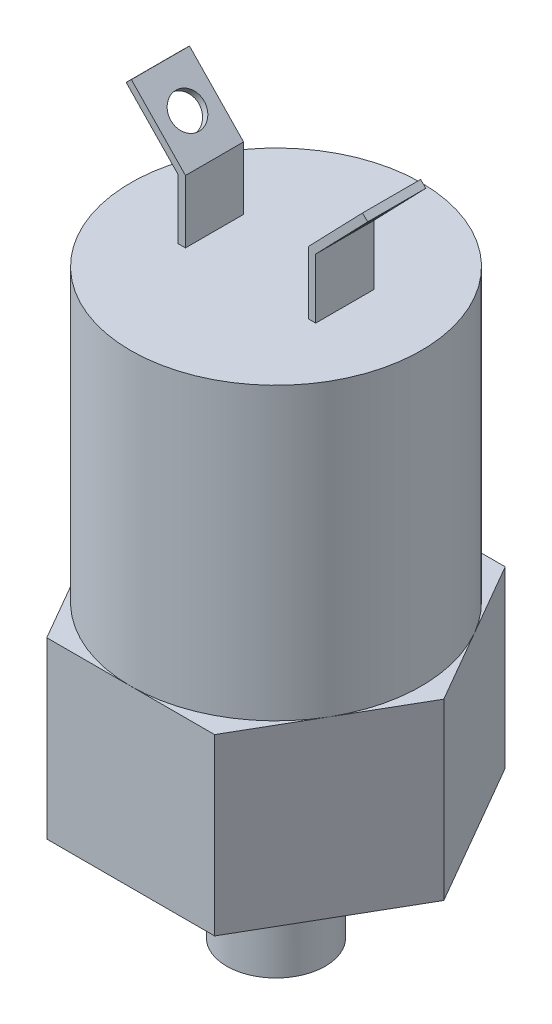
from build123d import *

# Parameters (mm, degrees)
BOSS_EXTRUDE1_DEPTH = 15.24
SKETCH3_R           = 12.7
BOSS_EXTRUDE2_DEPTH = 25.4
SKETCH4_R           = 4.3053
BOSS_EXTRUDE3_DEPTH = 10.16
EXTRUDE_THIN1_DEPTH = 2.54
CUT_EXTRUDE1_REACH  = 50.698
SKETCH6_R           = 1.4605


with BuildPart() as part:
    # Sketch2 → Boss-Extrude1 (new body)
    with BuildSketch(Plane(origin=(0, 0, 0), x_dir=(1, 0, 0), z_dir=(0, 1, 0))):
        Polygon((7.332348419, 12.7), (-7.332348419, 12.7), (-14.664696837, 0), (-7.332348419, -12.7), (7.332348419, -12.7), (14.664696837, 0), align=None)
    extrude(amount=BOSS_EXTRUDE1_DEPTH)

    # Sketch3 → Boss-Extrude2 (add)
    with BuildSketch(Plane(origin=(0, 15.24, 0), x_dir=(1, 0, 0), z_dir=(0, 1, 0))):
        with Locations(Location((0, 0, 0), (0, 0, 270))):
            Circle(SKETCH3_R)
    extrude(amount=BOSS_EXTRUDE2_DEPTH)

    # Sketch4 → Boss-Extrude3 (add)
    with BuildSketch(Plane.XZ):
        with Locations(Location((0, 0, 0), (0, 0, 90))):
            Circle(SKETCH4_R)
    extrude(amount=BOSS_EXTRUDE3_DEPTH)

    # Sketch5 → Extrude-Thin1 (add, symmetric)
    with BuildSketch(Plane.XY):
        Polygon((6.008182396, 40.64), (6.008182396, 45.866997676), (10.555270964, 50.579540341), (10.098307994, 51.020459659), (5.373182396, 46.123401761), (5.373182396, 40.64), align=None)
    extrude_thin1 = extrude(amount=EXTRUDE_THIN1_DEPTH, both=True)

    # Sketch6 → Cut-Extrude1 (cut, up to next)
    with BuildSketch(Plane(origin=(-20.264409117, 19.552939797, 0), x_dir=(0, 0, 1), z_dir=(-0.7196267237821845, 0.6943611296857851, 0)), mode=Mode.PRIVATE) as cut_extrude1_sk1:
        with Locations(Location((0, 40.325060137, 0), (0, 0, 270))):
            Circle(SKETCH6_R)
    cut_extrude1_tool1 = extrude(cut_extrude1_sk1.sketch, amount=-CUT_EXTRUDE1_REACH, mode=Mode.PRIVATE) & part.part
    cut_extrude1 = cut_extrude1_tool1.solids().sort_by_distance((7.735745, 48.571931, 0))[0]
    add(cut_extrude1, mode=Mode.SUBTRACT)

    # Mirror1: Extrude-Thin1, Cut-Extrude1 across plane
    add(extrude_thin1.mirror(Plane(origin=(0, 0, 0), x_dir=(0, 0, 1), z_dir=(1, 0, 0))))
    add(cut_extrude1.mirror(Plane(origin=(0, 0, 0), x_dir=(0, 0, 1), z_dir=(1, 0, 0))), mode=Mode.SUBTRACT)


solid = part.part
